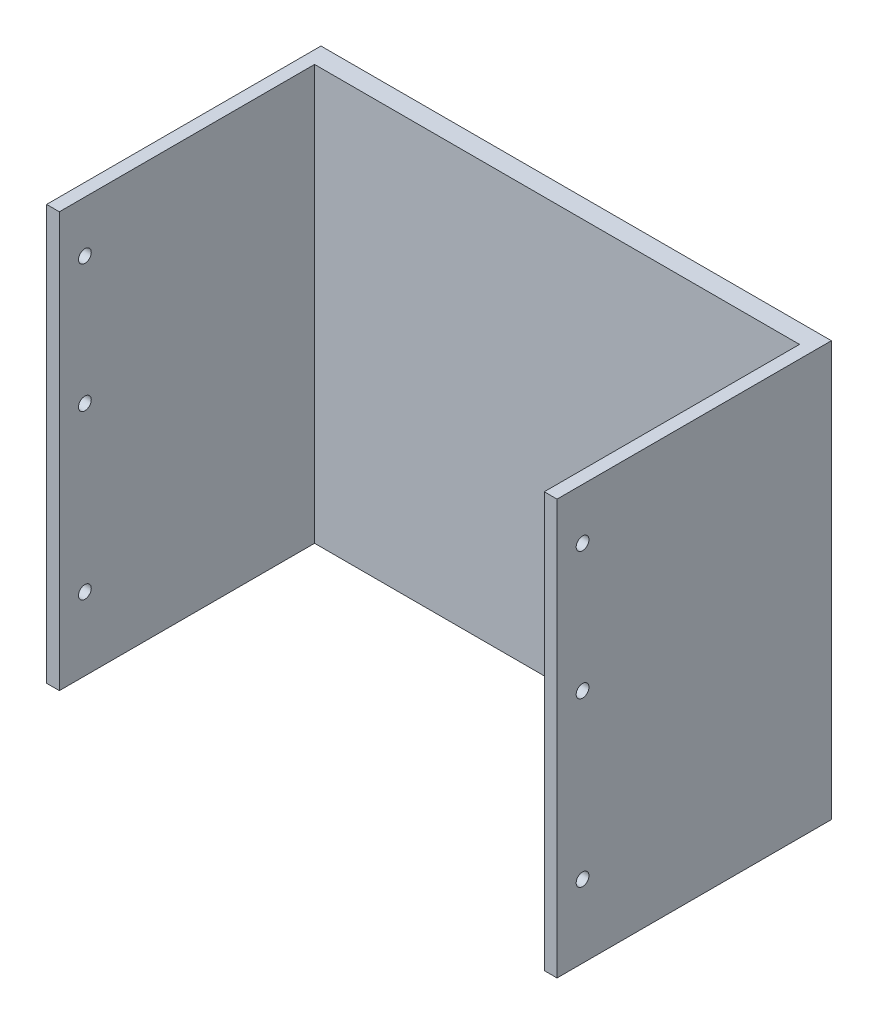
from build123d import *

# Parameters (mm, degrees)
SKETCH_1_W          = 80
SKETCH_1_H          = 65
EXTRUDE_1_DEPTH     = 3
SKETCH_2_W          = 2
SKETCH_2_H          = 65
EXTRUDE_2_DEPTH     = 40
SKETCH_3_R          = 1
CUT_EXTRUDE_1_DEPTH = 10


with BuildPart() as part:
    # Sketch 1 → Extrude 1 (new body)
    with BuildSketch(Plane.XY):
        Rectangle(SKETCH_1_W, SKETCH_1_H)
    extrude(amount=EXTRUDE_1_DEPTH)

    # Sketch 2 → Extrude 2 (add)
    with BuildSketch(Plane.XY.offset(3)):
        with Locations((-39, 0)):
            Rectangle(SKETCH_2_W, SKETCH_2_H)
        with Locations((39, 0)):
            Rectangle(SKETCH_2_W, SKETCH_2_H)
    extrude(amount=EXTRUDE_2_DEPTH)

    # Sketch 3 → Cut-Extrude 1 (cut)
    with BuildSketch(Plane.ZY.offset(40)):
        with Locations(Location((39, 24.5, 0), (0, 0, 270))):
            Circle(SKETCH_3_R)
        with Locations(Location((39, -21.095145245, 0), (0, 0, 270))):
            Circle(SKETCH_3_R)
        with Locations(Location((39, 4.485352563, 0), (0, 0, 270))):
            Circle(SKETCH_3_R)
    cut_extrude_1 = extrude(amount=-CUT_EXTRUDE_1_DEPTH, mode=Mode.SUBTRACT)

    # Mirror 1: Cut-Extrude 1 across plane
    add(cut_extrude_1.mirror(Plane(origin=(0, 0, 0), x_dir=(0, 0, 1), z_dir=(1, 0, 0))), mode=Mode.SUBTRACT)


solid = part.part
